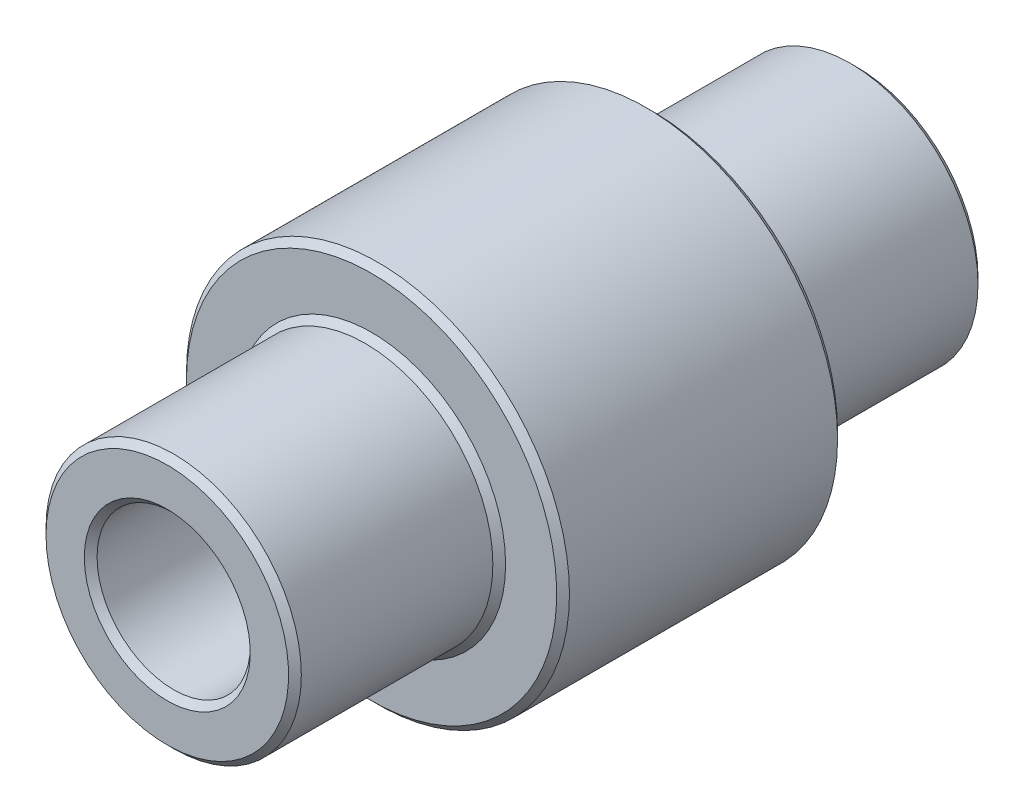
from build123d import *

# Parameters (mm, degrees)
CHAMFER_1_SIZE = 0.5


with BuildPart() as part:
    # Sketch 1 → Revolve 1 (revolve)
    with BuildSketch(Plane(origin=(0, 0, 0), x_dir=(0, 0, -1), z_dir=(1, 0, 0)), mode=Mode.PRIVATE) as revolve_1_sk:
        Polygon((-27, 6), (-27, 10), (-11, 10), (-11, 15), (11, 15), (11, 10), (27, 10), (27, 6), align=None)
    revolve(revolve_1_sk.sketch.rotate(Axis((0, 0, 27), (0, 0, -1)), 90), axis=Axis((0, 0, 27), (0, 0, -1)))

    # Chamfer 1
    chamfer_1_edges = [part.edges().sort_by_distance(p)[0] for p in [
        (-6, 0, -27),
        (-10, 0, -27),
        (-10, 0, -11),
        (-15, 0, -11),
        (-15, 0, 11),
        (-10, 0, 11),
        (-10, 0, 27),
        (-6, 0, 27),
    ]]
    chamfer(chamfer_1_edges, length=CHAMFER_1_SIZE)


solid = part.part
